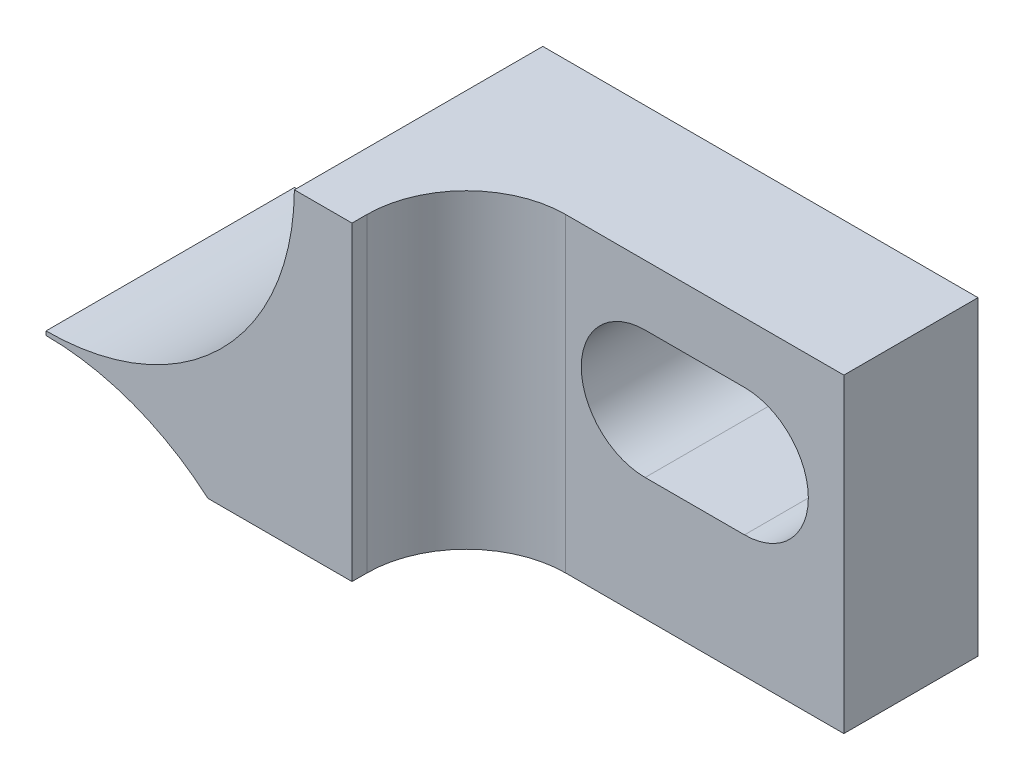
from build123d import *

# Parameters (mm, degrees)
SKETCH1_R           = 1.63195
EXTRUDE1_DEPTH      = 6.35
SKETCH5_W           = 15.98667914
SKETCH5_H           = 1.5875
CUT_EXTRUDE4_DEPTH  = 116.178567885
SKETCH6_W           = 6.35
SKETCH6_H           = 3.175
CUT_EXTRUDE5_DEPTH  = 116.178567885
CUT_EXTRUDE6_DEPTH  = 115.75110634
CUT_EXTRUDE7_DEPTH  = 115.871833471
SKETCH9_R           = 1.63195
CUT_EXTRUDE8_DEPTH  = 6.35
EXTRUDE2_DEPTH      = 2.54
EXTRUDE2_DEPTH_BACK = 116.178567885
SKETCH10_W          = 104.383265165
SKETCH10_H          = 41.601620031


with BuildPart() as part:
    # Sketch1 → Extrude1 (new body)
    with BuildSketch(Plane.XY):
        with BuildLine():
            Line((0, 9.525), (0, 0))
            Line((0, 0), (7.950403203, 0))
            ThreePointArc((7.950403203, 0), (12.65282779, 6.081790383), (19.769817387, 3.175))
            Line((19.769817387, 3.175), (91.355182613, 3.175))
            ThreePointArc((91.355182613, 3.175), (96.8248, 6.2992), (102.294417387, 3.175))
            Line((102.294417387, 3.175), (114.3, 3.175))
            Line((114.3, 3.175), (114.3, 12.7))
            Line((114.3, 12.7), (103.174596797, 12.7))
            ThreePointArc((103.174596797, 12.7), (98.47217221, 6.618209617), (91.355182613, 9.525))
            Line((91.355182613, 9.525), (19.769817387, 9.525))
            ThreePointArc((19.769817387, 9.525), (14.3002, 6.4008), (8.830582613, 9.525))
            Line((8.830582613, 9.525), (0, 9.525))
        make_face()
        with BuildLine():
            Line((109.22, 11.15695), (111.76, 11.15695))
            ThreePointArc((111.76, 11.15695), (113.39195, 9.525), (111.76, 7.89305))
            Line((111.76, 7.89305), (109.22, 7.89305))
            ThreePointArc((109.22, 7.89305), (107.58805, 9.525), (109.22, 11.15695))
        make_face(mode=Mode.SUBTRACT)
        with Locations(Location((3.175, 3.175, 0), (0, 0, 180))):
            Circle(SKETCH1_R, mode=Mode.SUBTRACT)
    extrude(amount=EXTRUDE1_DEPTH)

    # Sketch5 → Cut-Extrude4 (cut, through all)
    with BuildSketch(Plane(origin=(0, 0, 0), x_dir=(-1, 0, 0), z_dir=(0, 0, -1))):
        with Locations((-106.30666043, 3.96875)):
            Rectangle(SKETCH5_W, SKETCH5_H)
    extrude(amount=-CUT_EXTRUDE4_DEPTH, mode=Mode.SUBTRACT)

    # Sketch6 → Cut-Extrude5 (cut, through all)
    with BuildSketch(Plane.XZ):
        with Locations((3.175, 4.7625)):
            Rectangle(SKETCH6_W, SKETCH6_H)
    extrude(amount=-CUT_EXTRUDE5_DEPTH, mode=Mode.SUBTRACT)

    # Sketch7 → Cut-Extrude6 (cut, through all)
    with BuildSketch(Plane.XZ.offset(-4.7625)):
        with BuildLine():
            Line((114.3, 6.35), (104.648, 6.35))
            Line((104.648, 6.35), (104.648, 5.969))
            ThreePointArc((104.648, 5.969), (105.391948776, 4.172948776), (107.188, 3.429))
            Line((107.188, 3.429), (114.3, 3.429))
            Line((114.3, 3.429), (114.3, 6.35))
        make_face()
    extrude(amount=-CUT_EXTRUDE6_DEPTH, mode=Mode.SUBTRACT)

    # Sketch8 → Cut-Extrude7 (cut, through all)
    with BuildSketch(Plane.XZ.offset(-3.175)):
        with BuildLine():
            Line((25.4, 6.35), (25.4, 3.556))
            ThreePointArc((25.4, 3.556), (25.848403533, 5.182744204), (27.066958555, 6.35))
            Line((27.066958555, 6.35), (25.4, 6.35))
        make_face()
        with BuildLine():
            Line((31.75, 3.556), (31.75, 6.35))
            Line((31.75, 6.35), (30.083041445, 6.35))
            ThreePointArc((30.083041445, 6.35), (31.301596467, 5.182744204), (31.75, 3.556))
        make_face()
        with BuildLine():
            Line((25.4, 3.556), (31.75, 3.556))
            ThreePointArc((31.75, 3.556), (31.301596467, 5.182744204), (30.083041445, 6.35))
            Line((30.083041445, 6.35), (27.066958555, 6.35))
            ThreePointArc((27.066958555, 6.35), (25.848403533, 5.182744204), (25.4, 3.556))
        make_face()
        with BuildLine():
            ThreePointArc((25.4, 3.556), (28.575, 0.381), (31.75, 3.556))
            Line((31.75, 3.556), (25.4, 3.556))
        make_face()
        with BuildLine():
            Line((79.375, 6.35), (79.375, 3.556))
            ThreePointArc((79.375, 3.556), (79.823403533, 5.182744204), (81.041958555, 6.35))
            Line((81.041958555, 6.35), (79.375, 6.35))
        make_face()
        with BuildLine():
            Line((79.375, 3.556), (85.725, 3.556))
            ThreePointArc((85.725, 3.556), (85.276596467, 5.182744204), (84.058041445, 6.35))
            Line((84.058041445, 6.35), (81.041958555, 6.35))
            ThreePointArc((81.041958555, 6.35), (79.823403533, 5.182744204), (79.375, 3.556))
        make_face()
        with BuildLine():
            ThreePointArc((84.058041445, 6.35), (85.276596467, 5.182744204), (85.725, 3.556))
            Line((85.725, 3.556), (85.725, 6.35))
            Line((85.725, 6.35), (84.058041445, 6.35))
        make_face()
        with BuildLine():
            ThreePointArc((79.375, 3.556), (82.55, 0.381), (85.725, 3.556))
            Line((85.725, 3.556), (79.375, 3.556))
        make_face()
    extrude(amount=-CUT_EXTRUDE7_DEPTH, mode=Mode.SUBTRACT)

    # Sketch9 → Cut-Extrude8 (cut)
    with BuildSketch(Plane.XY.offset(6.35)):
        with Locations((39.37, 6.35)):
            Circle(SKETCH9_R)
        with Locations((74.93, 6.35)):
            Circle(SKETCH9_R)
    extrude(amount=-CUT_EXTRUDE8_DEPTH, mode=Mode.SUBTRACT)

    # Sketch10 → Extrude2 (cut, two sides: drawn at the far end of the back side and taken through both)
    with BuildSketch(Plane.XY.offset(6.35).offset(-EXTRUDE2_DEPTH_BACK)):
        with Locations((44.633167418, -0.816524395)):
            Rectangle(SKETCH10_W, SKETCH10_H)
    extrude(amount=EXTRUDE2_DEPTH + EXTRUDE2_DEPTH_BACK, mode=Mode.SUBTRACT)


solid = part.part
